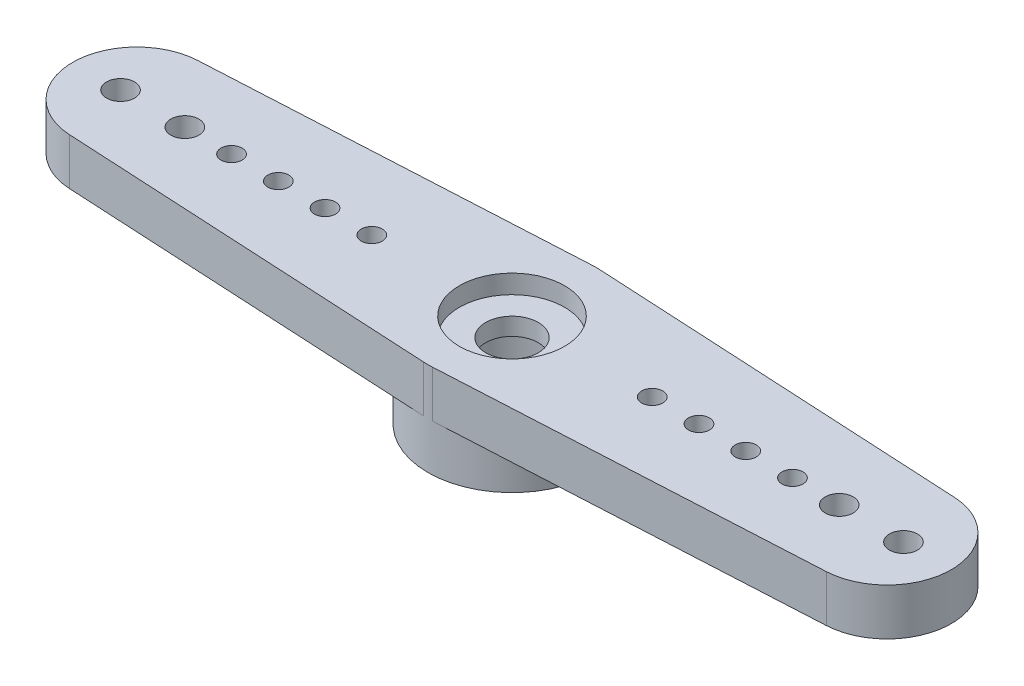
from build123d import *

# Parameters (mm, degrees)
BOSS_EXTRUDE1_START = 2
SKETCH3_R           = 0.6
SKETCH3_R_2         = 0.45
SKETCH3_R_3         = 2.425
BOSS_EXTRUDE1_DEPTH = 2


with BuildPart() as part:
    # Sketch2 → Revolve1 (revolve)
    with BuildSketch(Plane.XY, mode=Mode.PRIVATE) as revolve1_sk:
        Polygon((2.25, 2), (2.25, 1.2), (1.125, 1.2), (1.125, 0.45), (2.425, 0.45), (2.425, -2), (3.6, -2), (3.6, 2), align=None)
    revolve(revolve1_sk.sketch.rotate(Axis((0, 55, 0), (0, -1, 0)), 90), axis=Axis((0, 55, 0), (0, -1, 0)))

    # Sketch3 → Boss-Extrude1 (add)
    with BuildSketch(Plane(origin=(0, 0, 0), x_dir=(1, 0, 0), z_dir=(0, 1, 0)).offset(BOSS_EXTRUDE1_START)):
        with BuildLine():
            Line((0.190654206, -3.594947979), (16.195638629, -2.746140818))
            ThreePointArc((16.195638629, -2.746140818), (18.8, 0), (16.195638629, 2.746140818))
            Line((16.195638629, 2.746140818), (0.190654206, 3.594947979))
            ThreePointArc((0.190654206, 3.594947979), (0, 3.6), (-0.190654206, 3.594947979))
            Line((-0.190654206, 3.594947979), (-16.195638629, 2.746140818))
            ThreePointArc((-16.195638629, 2.746140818), (-18.8, 0), (-16.195638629, -2.746140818))
            Line((-16.195638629, -2.746140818), (-0.190654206, -3.594947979))
            ThreePointArc((-0.190654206, -3.594947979), (0, -3.6), (0.190654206, -3.594947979))
        make_face()
        with Locations(Location((-16.75, 0, 0), (0, 0, 90))):
            Circle(SKETCH3_R, mode=Mode.SUBTRACT)
        with Locations(Location((16.75, 0, 0), (0, 0, 90))):
            Circle(SKETCH3_R, mode=Mode.SUBTRACT)
        with Locations(Location((-14, 0, 0), (0, 0, 90))):
            Circle(SKETCH3_R, mode=Mode.SUBTRACT)
        with Locations(Location((14, 0, 0), (0, 0, 90))):
            Circle(SKETCH3_R, mode=Mode.SUBTRACT)
        with Locations(Location((-12, 0, 0), (0, 0, 90))):
            Circle(SKETCH3_R_2, mode=Mode.SUBTRACT)
        with Locations(Location((-10, 0, 0), (0, 0, 90))):
            Circle(SKETCH3_R_2, mode=Mode.SUBTRACT)
        with Locations(Location((-8, 0, 0), (0, 0, 90))):
            Circle(SKETCH3_R_2, mode=Mode.SUBTRACT)
        with Locations(Location((-6, 0, 0), (0, 0, 90))):
            Circle(SKETCH3_R_2, mode=Mode.SUBTRACT)
        with Locations(Location((6, 0, 0), (0, 0, 90))):
            Circle(SKETCH3_R_2, mode=Mode.SUBTRACT)
        with Locations(Location((8, 0, 0), (0, 0, 90))):
            Circle(SKETCH3_R_2, mode=Mode.SUBTRACT)
        with Locations(Location((10, 0, 0), (0, 0, 90))):
            Circle(SKETCH3_R_2, mode=Mode.SUBTRACT)
        with Locations(Location((12, 0, 0), (0, 0, 90))):
            Circle(SKETCH3_R_2, mode=Mode.SUBTRACT)
        with Locations(Location((0, 0, 0), (0, 0, 270))):
            Circle(SKETCH3_R_3, mode=Mode.SUBTRACT)
    extrude(amount=-BOSS_EXTRUDE1_DEPTH)


solid = part.part
